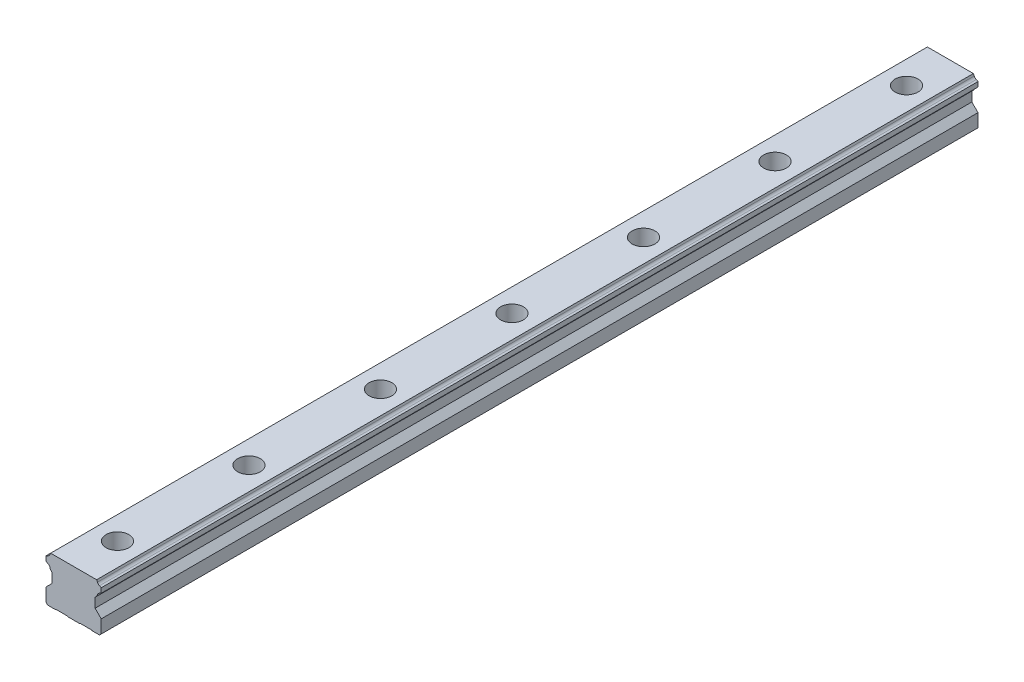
from build123d import *

# Parameters (mm, degrees)
BOSS_EXTRUDE1_DEPTH                                  = 500
CBORE_FOR_M12_HEX_SOCKET_HEAD_CAP_SCREW1_D           = 18
CBORE_FOR_M12_HEX_SOCKET_HEAD_CAP_SCREW1_CBORE_D     = 26
CBORE_FOR_M12_HEX_SOCKET_HEAD_CAP_SCREW1_CBORE_DEPTH = 22
LPATTERN1_COUNT                                      = 7
LPATTERN1_PITCH                                      = 150


with BuildPart() as part:
    # Sketch1 → Boss-Extrude1 (new, symmetric)
    with BuildSketch(Plane.XY):
        with BuildLine():
            Line((31.5, 17), (31.5, 2))
            Line((31.5, 2), (29.5, 0))
            Line((29.5, 0), (21, 0))
            Line((21, 0), (20.5, 0.5))
            Line((20.5, 0.5), (7.707106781, 0.5))
            ThreePointArc((7.707106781, 0.5), (7.515765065, 0.461939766), (7.353553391, 0.353553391))
            Line((7.353553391, 0.353553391), (7, 0))
            Line((7, 0), (-7, 0))
            Line((-7, 0), (-7.353553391, 0.353553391))
            ThreePointArc((-7.353553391, 0.353553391), (-7.515765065, 0.461939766), (-7.707106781, 0.5))
            Line((-7.707106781, 0.5), (-20.5, 0.5))
            Line((-20.5, 0.5), (-21, 0))
            Line((-21, 0), (-29.5, 0))
            Line((-29.5, 0), (-31.5, 2))
            Line((-31.5, 2), (-31.5, 17))
            Line((-31.5, 17), (-24.5, 24))
            Line((-24.5, 24), (-24.5, 34.8))
            Line((-24.5, 34.8), (-26.697921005, 36.998))
            ThreePointArc((-26.697921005, 36.998), (-27.486404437, 39.570021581), (-29.513887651, 41.338159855))
            Line((-29.513887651, 41.338159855), (-31.5, 42.271))
            Line((-31.5, 42.271), (-31.5, 47.73))
            Line((-31.5, 47.73), (-29.515718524, 48.660980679))
            ThreePointArc((-29.515718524, 48.660980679), (-28.132176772, 49.632176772), (-27.160980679, 51.015718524))
            Line((-27.160980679, 51.015718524), (-26.23, 53))
            Line((-26.23, 53), (26.23, 53))
            Line((26.23, 53), (27.160980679, 51.015718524))
            ThreePointArc((27.160980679, 51.015718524), (28.132176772, 49.632176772), (29.515718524, 48.660980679))
            Line((29.515718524, 48.660980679), (31.5, 47.73))
            Line((31.5, 47.73), (31.5, 42.271))
            Line((31.5, 42.271), (29.513887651, 41.338159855))
            ThreePointArc((29.513887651, 41.338159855), (27.486404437, 39.570021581), (26.697921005, 36.998))
            Line((26.697921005, 36.998), (24.5, 34.8))
            Line((24.5, 34.8), (24.5, 24))
            Line((24.5, 24), (31.5, 17))
        make_face()
    extrude(amount=BOSS_EXTRUDE1_DEPTH, both=True)

    # CBORE for M12 Hex Socket Head Cap Screw1 (through all)
    with Locations(Plane(origin=(0, 53, 0), x_dir=(1, 0, 0), z_dir=(0, 1, 0))):
        with Locations((0, -450)):
            cbore_for_m12_hex_socket_head_cap_screw1 = CounterBoreHole(CBORE_FOR_M12_HEX_SOCKET_HEAD_CAP_SCREW1_D / 2, CBORE_FOR_M12_HEX_SOCKET_HEAD_CAP_SCREW1_CBORE_D / 2, CBORE_FOR_M12_HEX_SOCKET_HEAD_CAP_SCREW1_CBORE_DEPTH)

    # LPattern1: CBORE for M12 Hex Socket Head Cap Screw1 ×7
    with Locations(*[(0, 0, -i * LPATTERN1_PITCH) for i in range(1, LPATTERN1_COUNT)]):
        add(cbore_for_m12_hex_socket_head_cap_screw1, mode=Mode.SUBTRACT)


solid = part.part
